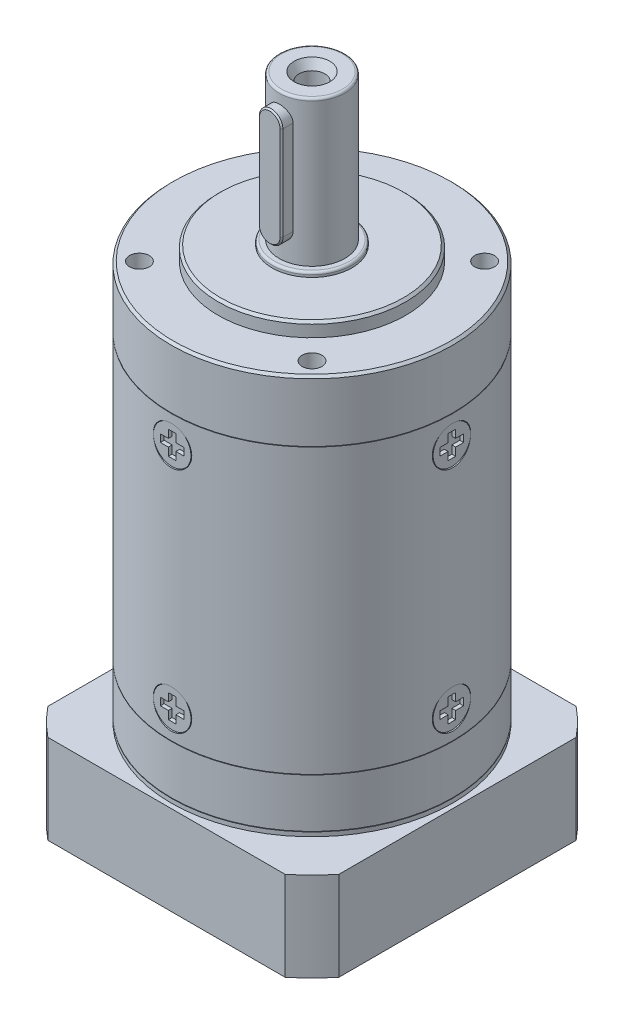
from build123d import *

# Parameters (mm, degrees)
SKETCH_1_R                = 20
EXTRUDE_1_DEPTH           = 3
SKETCH_2_R                = 30
EXTRUDE_2_DEPTH           = 13
SKETCH_3_R                = 30
EXTRUDE_3_DEPTH           = 60.4
SKETCH_4_R                = 30
EXTRUDE_4_DEPTH           = 10.4
SKETCH_5_R                = 30
EXTRUDE_5_DEPTH           = 0.9
EXTRUDE_6_DEPTH           = 19
SKETCH_7_R                = 25
CUT_EXTRUDE_1_DEPTH       = 5
SKETCH_8_R                = 17.5
CUT_EXTRUDE_2_DEPTH       = 19
SKETCH_9_R                = 16
EXTRUDE_7_DEPTH           = 17
CHAMFER_1_SIZE            = 1
SKETCH_10_R               = 7
CUT_EXTRUDE_3_DEPTH       = 32
SKETCH_11_W               = 33.69437378
SKETCH_11_H               = 1
CUT_EXTRUDE_4_DEPTH       = 17
SKETCH_12_R               = 4
CUT_EXTRUDE_5_DEPTH       = 12
PATTERN_CIRCULAR_1_COUNT  = 4
CHAMFER_3_SIZE            = 0.5
PATTERN_CIRCULAR_2_COUNT  = 4
SKETCH_15_R               = 8.5
EXTRUDE_8_DEPTH           = 1
SKETCH_16_R               = 7
EXTRUDE_9_DEPTH           = 31
FILLET_1_R                = 0.5
FILLET_2_R                = 0.5
SKETCH_19_R               = 4.1
CUT_EXTRUDE_6_DEPTH       = 31
PATTERN_CIRCULAR_5_COUNT  = 4
SKETCH_20_R               = 4
EXTRUDE_10_DEPTH          = 0.8
PATTERN_CIRCULAR_21_COUNT = 4
SKETCH_21_R               = 3.5
EXTRUDE_11_DEPTH          = 4
PATTERN_CIRCULAR_22_COUNT = 4
EXTRUDE_12_DEPTH          = 9
CHAMFER_4_SIZE            = 0.3
CHAMFER_5_SIZE            = 0.5
SKETCH_25_R               = 2.75
CUT_EXTRUDE_7_DEPTH       = 4.8
SKETCH_26_R               = 2.75
SKETCH_28_R               = 3.8
PATTERN_CIRCULAR_23_COUNT = 4


with BuildPart() as part:
    # Sketch 1 → Extrude 1 (new body)
    with BuildSketch(Plane(origin=(0, 0, 0), x_dir=(1, 0, 0), z_dir=(0, 1, 0))):
        with Locations(Location((0, 0, 0), (0, 0, 270))):
            Circle(SKETCH_1_R)
    extrude(amount=EXTRUDE_1_DEPTH)

    # Sketch 2 → Extrude 2 (add)
    with BuildSketch(Plane.XZ):
        with Locations(Location((0, 0, 0), (0, 0, 90))):
            Circle(SKETCH_2_R)
    extrude(amount=EXTRUDE_2_DEPTH)

    # Chamfer 3
    chamfer_3_edges = [part.edges().sort_by_distance(p)[0] for p in [
        (0, 3, -20),
    ]]
    chamfer(chamfer_3_edges, length=CHAMFER_3_SIZE)

    # Sketch 15 → Extrude 8 (add)
    with BuildSketch(Plane(origin=(0, 3, 0), x_dir=(1, 0, 0), z_dir=(0, 1, 0))):
        with Locations(Location((0, 0, 0), (0, 0, 270))):
            Circle(SKETCH_15_R)
    extrude(amount=EXTRUDE_8_DEPTH)

    # Sketch 16 → Extrude 9 (add)
    with BuildSketch(Plane(origin=(0, 4, 0), x_dir=(1, 0, 0), z_dir=(0, 1, 0))):
        with Locations(Location((0, 0, 0), (0, 0, 90))):
            Circle(SKETCH_16_R)
    extrude(amount=EXTRUDE_9_DEPTH)

    # Fillet 1
    fillet_1_edges = [part.edges().sort_by_distance(p)[0] for p in [
        (0, 4, -8.5),
    ]]
    fillet(fillet_1_edges, radius=FILLET_1_R)

    # Fillet 2
    fillet_2_edges = [part.edges().sort_by_distance(p)[0] for p in [
        (0, 35, 7),
    ]]
    fillet(fillet_2_edges, radius=FILLET_2_R)

    # Sketch 22 → Extrude 12 (add)
    with BuildSketch(Plane.XY):
        with BuildLine():
            Line((-2.5, 30), (-2.5, 10))
            ThreePointArc((-2.5, 10), (0, 7.5), (2.5, 10))
            Line((2.5, 10), (2.5, 30))
            ThreePointArc((2.5, 30), (0, 32.5), (-2.5, 30))
        make_face()
    extrude(amount=EXTRUDE_12_DEPTH)

    # Chamfer 4
    chamfer_4_edges = [part.edges().sort_by_distance(p)[0] for p in [
        (0, 32.5, 9),
        (-2.5, 20, 9),
        (0, 7.5, 9),
        (2.5, 20, 9),
    ]]
    chamfer(chamfer_4_edges, length=CHAMFER_4_SIZE)

    # Chamfer 5
    chamfer_5_edges = [part.edges().sort_by_distance(p)[0] for p in [
        (0, 0, -30),
    ]]
    chamfer(chamfer_5_edges, length=CHAMFER_5_SIZE)

    # Sketch 25 → Cut-Extrude 7 (cut)
    with BuildSketch(Plane(origin=(0, 35, 0), x_dir=(1, 0, 0), z_dir=(0, 1, 0))):
        with Locations(Location((0, 0, 0), (0, 0, 270))):
            Circle(SKETCH_25_R)
    extrude(amount=-CUT_EXTRUDE_7_DEPTH, mode=Mode.SUBTRACT)

    # Sketch 26 → Loft 1 section 0
    with BuildSketch(Plane(origin=(0, 33.2, 0), x_dir=(-1, 0, 0), z_dir=(0, 1, 0))):
        Circle(SKETCH_26_R)
    # Sketch 28 → Loft 1 section 1
    with BuildSketch(Plane(origin=(0, 35, 0), x_dir=(1, 0, 0), z_dir=(0, 1, 0))):
        Circle(SKETCH_28_R)
    loft(mode=Mode.SUBTRACT)

    # Sketch 29 → Hole Wizard M5 _1 (revolve, cut)
    with BuildSketch(Plane(origin=(0, 30.2, 0), x_dir=(0, 0, 1), z_dir=(1, 0, 0))):
        Polygon((0, 0), (0, 12.9618073), (2.1, 11.7), (2.1, 0), align=None)
    revolve(axis=Axis((0, 36.55, 0), (0, -1, 0)), mode=Mode.SUBTRACT)


with BuildPart() as body_2:
    # Sketch 3 → Extrude 3 (new body)
    with BuildSketch(Plane.XZ.offset(13.1)):
        with Locations(Location((0, 0, 0), (0, 0, 270))):
            Circle(SKETCH_3_R)
    extrude(amount=EXTRUDE_3_DEPTH)


with BuildPart() as body_3:
    # Sketch 4 → Extrude 4 (new body)
    with BuildSketch(Plane.XZ.offset(73.6)):
        with Locations(Location((0, 0, 0), (0, 0, 270))):
            Circle(SKETCH_4_R)
    extrude(amount=EXTRUDE_4_DEPTH)


with BuildPart() as body_4:
    # Sketch 5 → Extrude 5 (new body)
    with BuildSketch(Plane.XZ.offset(84.1)):
        with Locations(Location((0, 0, 0), (0, 0, 270))):
            Circle(SKETCH_5_R)
    extrude(amount=EXTRUDE_5_DEPTH)

    # Sketch 6 → Extrude 6 (add)
    with BuildSketch(Plane.XZ.offset(85)):
        with BuildLine():
            Line((-25.27844932, 31), (25.27844932, 31))
            ThreePointArc((25.27844932, 31), (28.284271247, 28.284271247), (31, 25.27844932))
            Line((31, 25.27844932), (31, -25.27844932))
            ThreePointArc((31, -25.27844932), (28.284271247, -28.284271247), (25.27844932, -31))
            Line((25.27844932, -31), (-25.27844932, -31))
            ThreePointArc((-25.27844932, -31), (-28.284271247, -28.284271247), (-31, -25.27844932))
            Line((-31, -25.27844932), (-31, 25.27844932))
            ThreePointArc((-31, 25.27844932), (-28.284271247, 28.284271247), (-25.27844932, 31))
        make_face()
    extrude(amount=EXTRUDE_6_DEPTH)

    # Sketch 7 → Cut-Extrude 1 (cut)
    with BuildSketch(Plane.XZ.offset(104)):
        with Locations(Location((0, 0, 0), (0, 0, 270))):
            Circle(SKETCH_7_R)
    extrude(amount=-CUT_EXTRUDE_1_DEPTH, mode=Mode.SUBTRACT)


with BuildPart() as cut_extrude_2_tool:
    # Sketch 8 → Cut-Extrude 2 (new body)
    with BuildSketch(Plane.XZ.offset(99)):
        with Locations(Location((0, 0, 0), (0, 0, 270))):
            Circle(SKETCH_8_R)
    extrude(amount=-CUT_EXTRUDE_2_DEPTH)


with BuildPart() as body_3_1:
    add(body_3.part)

    # Cut-Extrude 2: cut by cut_extrude_2_tool
    add(cut_extrude_2_tool.part, mode=Mode.SUBTRACT)

    # Sketch 9 → Extrude 7 (add)
    with BuildSketch(Plane.XZ.offset(97)):
        with Locations(Location((0, 0, 0), (0, 0, 270))):
            Circle(SKETCH_9_R)
    extrude(amount=-EXTRUDE_7_DEPTH)

    # Chamfer 1
    chamfer_1_edges = [body_3_1.edges().sort_by_distance(p)[0] for p in [
        (0, -97, 16),
    ]]
    chamfer(chamfer_1_edges, length=CHAMFER_1_SIZE)


with BuildPart() as body_4_1:
    add(body_4.part)

    # Cut-Extrude 2: cut by cut_extrude_2_tool
    add(cut_extrude_2_tool.part, mode=Mode.SUBTRACT)

    # Sketch 12 → Cut-Extrude 5 (cut)
    with BuildSketch(Plane.XZ.offset(104)):
        with Locations(Location((-12.75, 22.083647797, 0), (0, 0, 270))):
            Circle(SKETCH_12_R)
    cut_extrude_5 = extrude(amount=-CUT_EXTRUDE_5_DEPTH, mode=Mode.SUBTRACT)

    # Pattern Circular 1: Cut-Extrude 5 ×4 about axis
    pattern_circular_1_axis = Axis((0, 0, 0), (0, 1, 0))
    for i in range(1, PATTERN_CIRCULAR_1_COUNT):
        add(cut_extrude_5.rotate(pattern_circular_1_axis, i * 360 / PATTERN_CIRCULAR_1_COUNT), mode=Mode.SUBTRACT)

    # Sketch 14 → Hole Wizard M4 _1 (revolve, cut)
    with BuildSketch(Plane(origin=(-24.748737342, -104, -24.748737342), x_dir=(0, 0, -1), z_dir=(1, 0, 0))):
        Polygon((0, 0), (0, 14.491420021), (1.65, 13.5), (1.65, 0), align=None)
    hole_wizard_m4_1 = revolve(axis=Axis((-24.748737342, -110.35, -24.748737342), (0, 1, 0)), mode=Mode.SUBTRACT)

    # Pattern Circular 2: Hole Wizard M4 _1 ×4 about axis
    pattern_circular_2_axis = Axis((0, 0, 0), (0, 1, 0))
    for i in range(1, PATTERN_CIRCULAR_2_COUNT):
        add(hole_wizard_m4_1.rotate(pattern_circular_2_axis, i * 360 / PATTERN_CIRCULAR_2_COUNT), mode=Mode.SUBTRACT)

    # Sketch 21 → Extrude 11 (add)
    with BuildSketch(Plane.XZ.offset(92)):
        with Locations(Location((-12.75, 22.083647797, 0), (0, 0, 270))):
            Circle(SKETCH_21_R)
        Polygon((-11.866340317, 23.573327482), (-13.598270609, 23.593759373), (-14.481930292, 22.104079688), (-13.633659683, 20.593968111), (-11.901729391, 20.57353622), (-11.018069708, 22.063215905), align=None, mode=Mode.SUBTRACT)
    extrude_11 = extrude(amount=EXTRUDE_11_DEPTH)

    # Pattern Circular 22: Extrude 11 ×4 about axis
    pattern_circular_22_axis = Axis((0, 0, 0), (0, 1, 0))
    for i in range(1, PATTERN_CIRCULAR_22_COUNT):
        add(extrude_11.rotate(pattern_circular_22_axis, i * 360 / PATTERN_CIRCULAR_22_COUNT))


with BuildPart() as cut_extrude_3_tool:
    # Sketch 10 → Cut-Extrude 3 (new body)
    with BuildSketch(Plane.XZ.offset(104)):
        with Locations(Location((0, 0, 0), (0, 0, 270))):
            Circle(SKETCH_10_R)
    extrude(amount=-CUT_EXTRUDE_3_DEPTH)


with BuildPart() as body_2_1:
    add(body_2.part)

    # Cut-Extrude 3: cut by cut_extrude_3_tool
    add(cut_extrude_3_tool.part, mode=Mode.SUBTRACT)

    # Sketch 19 → Cut-Extrude 6 (cut)
    with BuildSketch(Plane.XY.offset(29)):
        with Locations(Location((0, -19, 0), (0, 0, 270))):
            Circle(SKETCH_19_R)
        with Locations(Location((0, -67.6, 0), (0, 0, 270))):
            Circle(SKETCH_19_R)
    cut_extrude_6 = extrude(amount=CUT_EXTRUDE_6_DEPTH, mode=Mode.SUBTRACT)

    # Pattern Circular 5: Cut-Extrude 6 ×4 about axis
    pattern_circular_5_axis = Axis((0, 0, 0), (0, 1, 0))
    for i in range(1, PATTERN_CIRCULAR_5_COUNT):
        add(cut_extrude_6.rotate(pattern_circular_5_axis, i * 360 / PATTERN_CIRCULAR_5_COUNT), mode=Mode.SUBTRACT)

    # Sketch 20 → Extrude 10 (add)
    # profile 1 of 2: a face of its own
    with BuildSketch(Plane.XY.offset(29)):
        with Locations((0, -19)):
            Circle(SKETCH_20_R)
        Polygon((0.8, -19.8), (0.8, -21.5), (-0.8, -21.5), (-0.8, -19.8), (-2.5, -19.8), (-2.5, -18.2), (-0.8, -18.2), (-0.8, -16.5), (0.8, -16.5), (0.8, -18.2), (2.5, -18.2), (2.5, -19.8), align=None, mode=Mode.SUBTRACT)
    # profile 2 of 2: a face of its own
    with BuildSketch(Plane.XY.offset(29)):
        with Locations((0, -67.6)):
            Circle(SKETCH_20_R)
        Polygon((0.8, -68.4), (0.8, -70.1), (-0.8, -70.1), (-0.8, -68.4), (-2.5, -68.4), (-2.5, -66.8), (-0.8, -66.8), (-0.8, -65.1), (0.8, -65.1), (0.8, -66.8), (2.5, -66.8), (2.5, -68.4), align=None, mode=Mode.SUBTRACT)
    extrude_10 = extrude(amount=EXTRUDE_10_DEPTH)

    # Pattern Circular 21: Extrude 10 ×4 about axis
    pattern_circular_21_axis = Axis((0, 0, 0), (0, 1, 0))
    for i in range(1, PATTERN_CIRCULAR_21_COUNT):
        add(extrude_10.rotate(pattern_circular_21_axis, i * 360 / PATTERN_CIRCULAR_21_COUNT))


with BuildPart() as body_3_2:
    add(body_3_1.part)

    # Cut-Extrude 3: cut by cut_extrude_3_tool
    add(cut_extrude_3_tool.part, mode=Mode.SUBTRACT)

    # Sketch 11 → Cut-Extrude 4 (cut)
    with BuildSketch(Plane.XZ.offset(97)):
        with Locations((0.125567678, 0)):
            Rectangle(SKETCH_11_W, SKETCH_11_H)
    extrude(amount=-CUT_EXTRUDE_4_DEPTH, mode=Mode.SUBTRACT)


with BuildPart() as hole_wizard_m5_2_tool:
    # Sketch 31 → Hole Wizard M5 _2 (revolve)
    with BuildSketch(Plane(origin=(-18.384776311, 0, -18.384776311), x_dir=(0, 0, 1), z_dir=(1, 0, 0))):
        Polygon((0, 0), (0, 17.2618073), (2.1, 16), (2.1, 0), align=None)
    hole_wizard_m5_2 = revolve(axis=Axis((-18.384776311, 6.35, -18.384776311), (0, -1, 0)))


with BuildPart() as part_1:
    add(part.part)

    # Hole Wizard M5 _2: cut by hole_wizard_m5_2_tool
    add(hole_wizard_m5_2_tool.part, mode=Mode.SUBTRACT)

    # Pattern Circular 23: Hole Wizard M5 _2 ×4 about axis
    pattern_circular_23_axis = Axis((0, 0, 0), (0, 1, 0))
    for i in range(1, PATTERN_CIRCULAR_23_COUNT):
        add(hole_wizard_m5_2.rotate(pattern_circular_23_axis, i * 360 / PATTERN_CIRCULAR_23_COUNT), mode=Mode.SUBTRACT)


with BuildPart() as body_2_2:
    add(body_2_1.part)

    # Hole Wizard M5 _2: cut by hole_wizard_m5_2_tool
    add(hole_wizard_m5_2_tool.part, mode=Mode.SUBTRACT)


solid = Compound([body_4_1.part, body_3_2.part, part_1.part, body_2_2.part])
